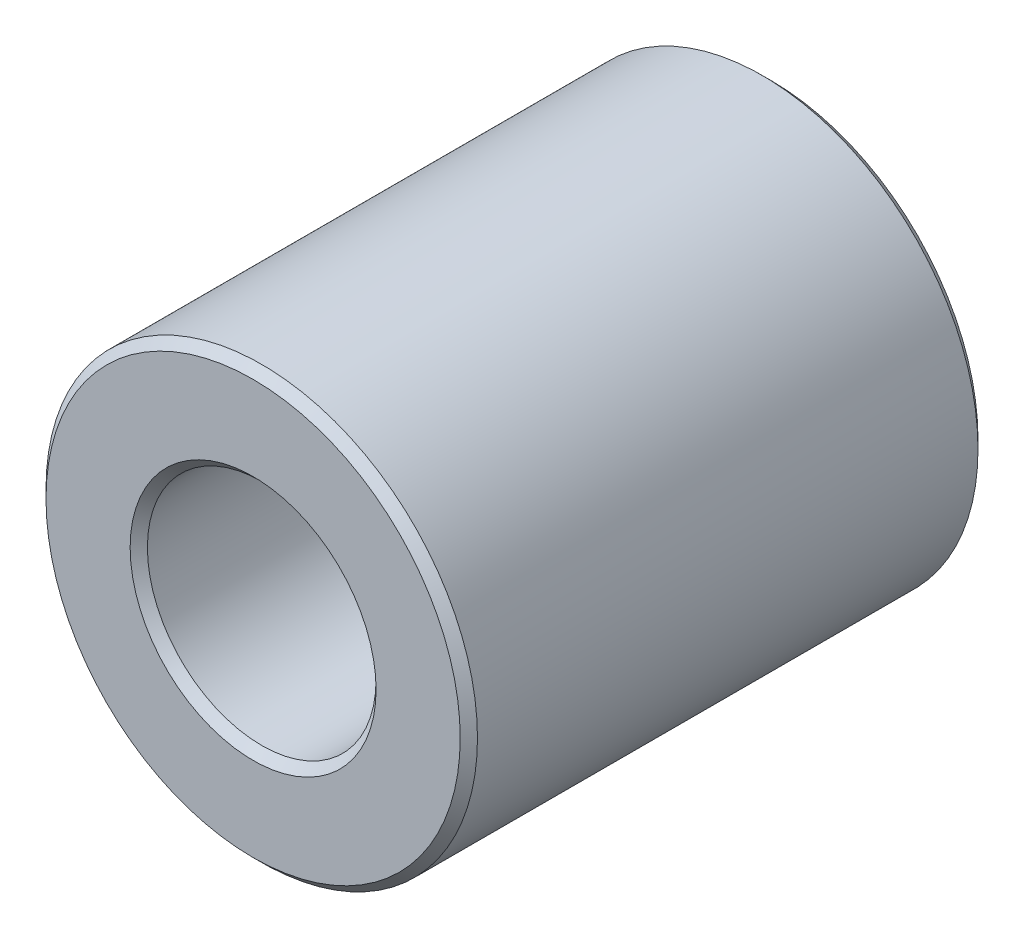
from build123d import *

# Parameters (mm, degrees)
SKETCH1_R           = 5
SKETCH1_R_2         = 2.65
BOSS_EXTRUDE2_DEPTH = 6
CHAMFER3_SIZE       = 0.2


with BuildPart() as part:
    # Sketch1 → Boss-Extrude2 (new, symmetric)
    with BuildSketch(Plane.XY):
        Circle(SKETCH1_R)
        Circle(SKETCH1_R_2, mode=Mode.SUBTRACT)
    extrude(amount=BOSS_EXTRUDE2_DEPTH, both=True)

    # Chamfer3
    chamfer3_edges = [part.edges().sort_by_distance(p)[0] for p in [
        (-5, 0, -6),
        (-5, 0, 6),
        (-2.65, 0, -6),
        (-2.65, 0, 6),
    ]]
    chamfer(chamfer3_edges, length=CHAMFER3_SIZE)


solid = part.part
